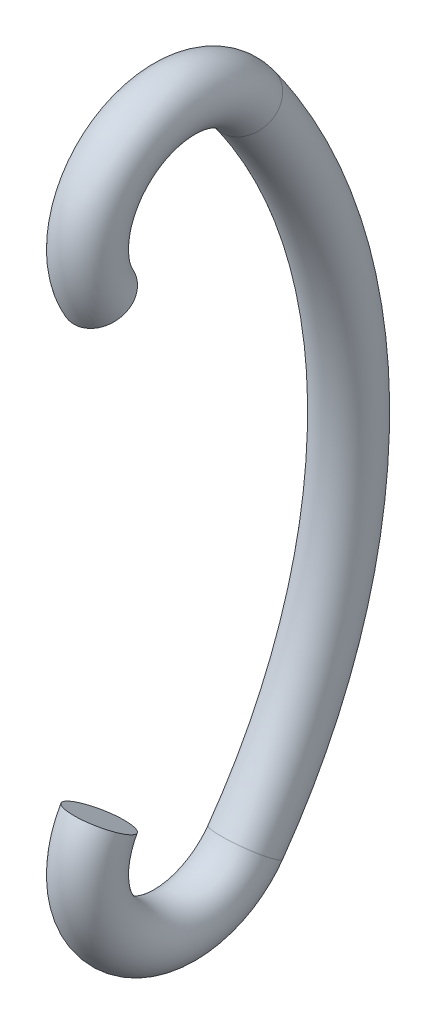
ISO-10303-21;
HEADER;
FILE_DESCRIPTION(('STEP AP214'),'2;1');
FILE_NAME('part.step','',(''),(''),'','','');
FILE_SCHEMA(('AUTOMOTIVE_DESIGN { 1 0 10303 214 1 1 1 1 }'));
ENDSEC;
DATA;
#1=APPLICATION_CONTEXT('core data for automotive mechanical design processes');
#2=APPLICATION_PROTOCOL_DEFINITION('international standard','automotive_design',2000,#1);
#3=PRODUCT_CONTEXT('',#1,'mechanical');
#4=PRODUCT('Part','Part','',(#3));
#5=PRODUCT_RELATED_PRODUCT_CATEGORY('part','',(#4));
#6=PRODUCT_DEFINITION_FORMATION('','',#4);
#7=PRODUCT_DEFINITION_CONTEXT('part definition',#1,'design');
#8=PRODUCT_DEFINITION('design','',#6,#7);
#9=PRODUCT_DEFINITION_SHAPE('','',#8);
#10=(LENGTH_UNIT() NAMED_UNIT(*) SI_UNIT(.MILLI.,.METRE.));
#11=(NAMED_UNIT(*) PLANE_ANGLE_UNIT() SI_UNIT($,.RADIAN.));
#12=(NAMED_UNIT(*) SI_UNIT($,.STERADIAN.) SOLID_ANGLE_UNIT());
#13=UNCERTAINTY_MEASURE_WITH_UNIT(LENGTH_MEASURE(1.E-05),#10,'distance_accuracy_value','');
#14=(GEOMETRIC_REPRESENTATION_CONTEXT(3) GLOBAL_UNCERTAINTY_ASSIGNED_CONTEXT((#13)) GLOBAL_UNIT_ASSIGNED_CONTEXT((#10,
#11,#12)) REPRESENTATION_CONTEXT('',''));
#15=CARTESIAN_POINT('',(0.,0.,0.));
#16=DIRECTION('',(0.,0.,1.));
#17=DIRECTION('',(1.,0.,0.));
#18=AXIS2_PLACEMENT_3D('',#15,#16,#17);
#19=CARTESIAN_POINT('',(0.,1.125,-0.649519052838));
#20=DIRECTION('',(0.,-0.866025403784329,0.50000000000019));
#21=DIRECTION('',(0.,-0.50000000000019,-0.866025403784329));
#22=AXIS2_PLACEMENT_3D('',#19,#20,#21);
#23=PLANE('',#22);
#24=CARTESIAN_POINT('',(0.,3.00000000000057,2.59807621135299));
#25=CARTESIAN_POINT('',(0.0842667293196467,3.00000289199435,2.59808122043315));
#26=CARTESIAN_POINT('',(0.168621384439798,3.00356719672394,2.60425477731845));
#27=CARTESIAN_POINT('',(0.293275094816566,3.01417075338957,2.62262067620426));
#28=CARTESIAN_POINT('',(0.334546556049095,3.01858727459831,2.63027031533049));
#29=CARTESIAN_POINT('',(0.416239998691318,3.02914557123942,2.64855782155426));
#30=CARTESIAN_POINT('',(0.456661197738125,3.03528886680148,2.65919832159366));
#31=CARTESIAN_POINT('',(0.576048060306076,3.05623034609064,2.69547002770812));
#32=CARTESIAN_POINT('',(0.653300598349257,3.07355412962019,2.72547570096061));
#33=CARTESIAN_POINT('',(0.80088418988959,3.11444867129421,2.79630712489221));
#34=CARTESIAN_POINT('',(0.871215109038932,3.13801955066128,2.83713308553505));
#35=CARTESIAN_POINT('',(0.969995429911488,3.17752846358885,2.90556453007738));
#36=CARTESIAN_POINT('',(1.001821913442,3.19140088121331,2.92959226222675));
#37=CARTESIAN_POINT('',(1.06299701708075,3.22042142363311,2.97985731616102));
#38=CARTESIAN_POINT('',(1.09234798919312,3.23556830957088,3.00609249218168));
#39=CARTESIAN_POINT('',(1.17642784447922,3.28279798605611,3.08789669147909));
#40=CARTESIAN_POINT('',(1.22720825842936,3.31667965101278,3.14658145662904));
#41=CARTESIAN_POINT('',(1.31664288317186,3.38820693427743,3.27047034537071));
#42=CARTESIAN_POINT('',(1.35529731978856,3.42585248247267,3.33567434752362));
#43=CARTESIAN_POINT('',(1.41942464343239,3.50385854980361,3.47078481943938));
#44=CARTESIAN_POINT('',(1.44489755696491,3.54421906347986,3.5406912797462));
#45=CARTESIAN_POINT('',(1.48192797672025,3.62650434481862,3.68321356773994));
#46=CARTESIAN_POINT('',(1.49348545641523,3.66842911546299,3.75582940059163));
#47=CARTESIAN_POINT('',(1.50235975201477,3.75265401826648,3.90171121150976));
#48=CARTESIAN_POINT('',(1.49967659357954,3.7949541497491,3.97497718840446));
#49=CARTESIAN_POINT('',(1.48014505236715,3.87872872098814,4.12007900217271));
#50=CARTESIAN_POINT('',(1.46329666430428,3.92020316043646,4.1919148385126));
#51=CARTESIAN_POINT('',(1.41591311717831,4.00114913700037,4.3321173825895));
#52=CARTESIAN_POINT('',(1.38537794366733,4.04062067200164,4.4004840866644));
#53=CARTESIAN_POINT('',(1.31148758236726,4.11644027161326,4.53180748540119));
#54=CARTESIAN_POINT('',(1.26813239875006,4.15278833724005,4.5947641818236));
#55=CARTESIAN_POINT('',(1.16983277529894,4.22132919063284,4.71348042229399));
#56=CARTESIAN_POINT('',(1.11488834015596,4.25352198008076,4.76923996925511));
#57=CARTESIAN_POINT('',(0.994969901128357,4.31283844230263,4.87197909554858));
#58=CARTESIAN_POINT('',(0.92999589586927,4.33996211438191,4.91895867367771));
#59=CARTESIAN_POINT('',(0.791862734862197,4.38837037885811,5.00280424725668));
#60=CARTESIAN_POINT('',(0.718703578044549,4.40965497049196,5.03967024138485));
#61=CARTESIAN_POINT('',(0.566276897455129,4.44578086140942,5.10224211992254));
#62=CARTESIAN_POINT('',(0.487009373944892,4.4606221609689,5.1279480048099));
#63=CARTESIAN_POINT('',(0.32461613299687,4.48344016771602,5.16746995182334));
#64=CARTESIAN_POINT('',(0.241490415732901,4.49141687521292,5.18128601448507));
#65=CARTESIAN_POINT('',(0.0737404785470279,4.50027926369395,5.19663612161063));
#66=CARTESIAN_POINT('',(-0.0108837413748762,4.50116494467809,5.19817016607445));
#67=CARTESIAN_POINT('',(-0.17922845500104,4.49582013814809,5.18891268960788));
#68=CARTESIAN_POINT('',(-0.262948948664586,4.48958965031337,5.17812116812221));
#69=CARTESIAN_POINT('',(-0.427109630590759,4.47018937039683,5.14451889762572));
#70=CARTESIAN_POINT('',(-0.507549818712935,4.4570195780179,5.12170814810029));
#71=CARTESIAN_POINT('',(-0.662866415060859,4.42411454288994,5.06471495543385));
#72=CARTESIAN_POINT('',(-0.737742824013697,4.4043793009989,5.03053251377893));
#73=CARTESIAN_POINT('',(-0.879806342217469,4.35890359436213,4.95176627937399));
#74=CARTESIAN_POINT('',(-0.946993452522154,4.33316313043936,4.90718248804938));
#75=CARTESIAN_POINT('',(-1.07177117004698,4.27640766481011,4.80887913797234));
#76=CARTESIAN_POINT('',(-1.12936177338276,4.24539266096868,4.75515957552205));
#77=CARTESIAN_POINT('',(-1.2333116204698,4.17896852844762,4.64010960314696));
#78=CARTESIAN_POINT('',(-1.27967086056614,4.14355939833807,4.57877919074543));
#79=CARTESIAN_POINT('',(-1.35984195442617,4.0693522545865,4.45024864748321));
#80=CARTESIAN_POINT('',(-1.39365382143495,4.03055424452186,4.38304852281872));
#81=CARTESIAN_POINT('',(-1.44777024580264,3.95067056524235,4.24468593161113));
#82=CARTESIAN_POINT('',(-1.46807480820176,3.90958489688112,4.17352346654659));
#83=CARTESIAN_POINT('',(-1.4946008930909,3.82629255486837,4.02925689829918));
#84=CARTESIAN_POINT('',(-1.50082239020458,3.78408587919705,3.9561527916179));
#85=CARTESIAN_POINT('',(-1.49900337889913,3.69974814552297,3.81007555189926));
#86=CARTESIAN_POINT('',(-1.49096289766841,3.65761708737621,3.73710241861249));
#87=CARTESIAN_POINT('',(-1.46085671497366,3.57463257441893,3.59336902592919));
#88=CARTESIAN_POINT('',(-1.43879098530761,3.5337791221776,3.52260877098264));
#89=CARTESIAN_POINT('',(-1.38122833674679,3.45448583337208,3.38526876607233));
#90=CARTESIAN_POINT('',(-1.34573116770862,3.4160460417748,3.31868909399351));
#91=CARTESIAN_POINT('',(-1.28324910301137,3.36107335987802,3.22347361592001));
#92=CARTESIAN_POINT('',(-1.26087738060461,3.34319391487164,3.19250550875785));
#93=CARTESIAN_POINT('',(-1.2131832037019,3.30842170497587,3.13227827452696));
#94=CARTESIAN_POINT('',(-1.18785793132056,3.29152990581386,3.10302082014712));
#95=CARTESIAN_POINT('',(-1.10777288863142,3.24257136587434,3.01822214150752));
#96=CARTESIAN_POINT('',(-1.04884722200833,3.21217173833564,2.96556844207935));
#97=CARTESIAN_POINT('',(-0.921615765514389,3.15675845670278,2.86958982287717));
#98=CARTESIAN_POINT('',(-0.853310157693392,3.13174469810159,2.82626472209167));
#99=CARTESIAN_POINT('',(-0.745312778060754,3.09879029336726,2.76918601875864));
#100=CARTESIAN_POINT('',(-0.708351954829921,3.08855883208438,2.75146460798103));
#101=CARTESIAN_POINT('',(-0.632875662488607,3.06969710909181,2.71879514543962));
#102=CARTESIAN_POINT('',(-0.59436159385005,3.06106544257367,2.70384466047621));
#103=CARTESIAN_POINT('',(-0.476892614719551,3.03767031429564,2.66332310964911));
#104=CARTESIAN_POINT('',(-0.395890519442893,3.02537005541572,2.64201843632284));
#105=CARTESIAN_POINT('',(-0.261991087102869,3.01105744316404,2.61722826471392));
#106=CARTESIAN_POINT('',(-0.209948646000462,3.00691674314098,2.61005636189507));
#107=CARTESIAN_POINT('',(-0.105282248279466,3.00138711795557,2.60047877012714));
#108=CARTESIAN_POINT('',(-0.0526582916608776,2.99999819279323,2.59807308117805));
#109=CARTESIAN_POINT('',(0.,3.00000000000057,2.59807621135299));
#110=B_SPLINE_CURVE_WITH_KNOTS('',3,(#24,#25,#26,#27,#28,#29,#30,#31,#32,#33,#34,#35,#36,#37,
#38,#39,#40,#41,#42,#43,#44,#45,#46,#47,#48,#49,#50,#51,#52,#53,#54,#55,#56,#57,#58,#59,#60,#61,
#62,#63,#64,#65,#66,#67,#68,#69,#70,#71,#72,#73,#74,#75,#76,#77,#78,#79,#80,#81,#82,#83,#84,#85,
#86,#87,#88,#89,#90,#91,#92,#93,#94,#95,#96,#97,#98,#99,#100,#101,#102,#103,#104,#105,#106,#107,
#108,#109),.UNSPECIFIED.,.T.,.F.,(4,2,2,2,2,2,2,2,2,2,2,2,2,2,2,2,2,2,2,2,2,2,2,2,2,2,2,2,2,2,2,
2,2,2,2,2,2,2,2,2,2,2,4),(0.,0.252574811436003,0.379071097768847,0.505679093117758,
0.758403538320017,1.01113288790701,1.13766709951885,1.26407970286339,1.51681156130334,
1.7695387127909,2.02226535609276,2.27499248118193,2.52771915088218,2.78044591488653,
3.03317294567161,3.28589989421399,3.53862674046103,3.79135362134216,4.04408053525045,
4.29680743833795,4.54953433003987,4.80226122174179,5.05498812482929,5.30771503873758,
5.56044191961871,5.81316876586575,6.06589571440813,6.3186227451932,6.57134950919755,
6.8240761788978,7.07680330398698,7.32952994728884,7.58225709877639,7.83498895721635,
7.96140156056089,8.08793577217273,8.34066512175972,8.59338956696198,8.71999756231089,
8.84649384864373,9.09906866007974,9.25690269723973,9.41473673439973),.UNSPECIFIED.);
#111=CARTESIAN_POINT('',(0.,3.00000000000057,2.59807621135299));
#112=VERTEX_POINT('',#111);
#113=EDGE_CURVE('E19',#112,#112,#110,.T.);
#114=ORIENTED_EDGE('',*,*,#113,.F.);
#115=EDGE_LOOP('',(#114));
#116=FACE_BOUND('',#115,.T.);
#117=ADVANCED_FACE('F15',(#116),#23,.F.);
#118=CARTESIAN_POINT('',(0.,29.875,-0.649519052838));
#119=DIRECTION('',(0.,-0.866025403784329,-0.50000000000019));
#120=DIRECTION('',(0.,0.50000000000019,-0.866025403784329));
#121=AXIS2_PLACEMENT_3D('',#118,#119,#120);
#122=PLANE('',#121);
#123=CARTESIAN_POINT('',(0.,27.9999999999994,2.59807621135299));
#124=CARTESIAN_POINT('',(-0.0842667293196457,27.9999971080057,2.59808122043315));
#125=CARTESIAN_POINT('',(-0.168621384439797,27.9964328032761,2.60425477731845));
#126=CARTESIAN_POINT('',(-0.293275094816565,27.9858292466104,2.62262067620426));
#127=CARTESIAN_POINT('',(-0.334546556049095,27.9814127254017,2.63027031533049));
#128=CARTESIAN_POINT('',(-0.416239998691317,27.9708544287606,2.64855782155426));
#129=CARTESIAN_POINT('',(-0.456661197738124,27.9647111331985,2.65919832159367));
#130=CARTESIAN_POINT('',(-0.576048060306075,27.9437696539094,2.69547002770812));
#131=CARTESIAN_POINT('',(-0.653300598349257,27.9264458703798,2.72547570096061));
#132=CARTESIAN_POINT('',(-0.800884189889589,27.8855513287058,2.79630712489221));
#133=CARTESIAN_POINT('',(-0.871215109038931,27.8619804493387,2.83713308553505));
#134=CARTESIAN_POINT('',(-0.969995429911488,27.8224715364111,2.90556453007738));
#135=CARTESIAN_POINT('',(-1.001821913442,27.8085991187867,2.92959226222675));
#136=CARTESIAN_POINT('',(-1.06299701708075,27.7795785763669,2.97985731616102));
#137=CARTESIAN_POINT('',(-1.09234798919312,27.7644316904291,3.00609249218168));
#138=CARTESIAN_POINT('',(-1.17642784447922,27.7172020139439,3.08789669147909));
#139=CARTESIAN_POINT('',(-1.22720825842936,27.6833203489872,3.14658145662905));
#140=CARTESIAN_POINT('',(-1.31664288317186,27.6117930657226,3.27047034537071));
#141=CARTESIAN_POINT('',(-1.35529731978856,27.5741475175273,3.33567434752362));
#142=CARTESIAN_POINT('',(-1.41942464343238,27.4961414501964,3.47078481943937));
#143=CARTESIAN_POINT('',(-1.44489755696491,27.4557809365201,3.5406912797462));
#144=CARTESIAN_POINT('',(-1.48192797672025,27.3734956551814,3.68321356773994));
#145=CARTESIAN_POINT('',(-1.49348545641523,27.331570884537,3.75582940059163));
#146=CARTESIAN_POINT('',(-1.50235975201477,27.2473459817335,3.90171121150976));
#147=CARTESIAN_POINT('',(-1.49967659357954,27.2050458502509,3.97497718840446));
#148=CARTESIAN_POINT('',(-1.48014505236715,27.1212712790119,4.12007900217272));
#149=CARTESIAN_POINT('',(-1.46329666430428,27.0797968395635,4.1919148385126));
#150=CARTESIAN_POINT('',(-1.41591311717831,26.9988508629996,4.3321173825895));
#151=CARTESIAN_POINT('',(-1.38537794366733,26.9593793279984,4.4004840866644));
#152=CARTESIAN_POINT('',(-1.31148758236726,26.8835597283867,4.53180748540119));
#153=CARTESIAN_POINT('',(-1.26813239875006,26.8472116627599,4.5947641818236));
#154=CARTESIAN_POINT('',(-1.16983277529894,26.7786708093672,4.71348042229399));
#155=CARTESIAN_POINT('',(-1.11488834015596,26.7464780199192,4.76923996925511));
#156=CARTESIAN_POINT('',(-0.994969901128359,26.6871615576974,4.87197909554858));
#157=CARTESIAN_POINT('',(-0.929995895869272,26.6600378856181,4.91895867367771));
#158=CARTESIAN_POINT('',(-0.791862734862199,26.6116296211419,5.00280424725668));
#159=CARTESIAN_POINT('',(-0.718703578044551,26.590345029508,5.03967024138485));
#160=CARTESIAN_POINT('',(-0.56627689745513,26.5542191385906,5.10224211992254));
#161=CARTESIAN_POINT('',(-0.487009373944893,26.5393778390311,5.1279480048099));
#162=CARTESIAN_POINT('',(-0.324616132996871,26.516559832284,5.16746995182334));
#163=CARTESIAN_POINT('',(-0.241490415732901,26.5085831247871,5.18128601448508));
#164=CARTESIAN_POINT('',(-0.0737404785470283,26.4997207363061,5.19663612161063));
#165=CARTESIAN_POINT('',(0.0108837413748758,26.4988350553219,5.19817016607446));
#166=CARTESIAN_POINT('',(0.179228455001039,26.5041798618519,5.18891268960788));
#167=CARTESIAN_POINT('',(0.262948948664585,26.5104103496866,5.17812116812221));
#168=CARTESIAN_POINT('',(0.427109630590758,26.5298106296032,5.14451889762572));
#169=CARTESIAN_POINT('',(0.507549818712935,26.5429804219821,5.12170814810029));
#170=CARTESIAN_POINT('',(0.662866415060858,26.5758854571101,5.06471495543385));
#171=CARTESIAN_POINT('',(0.737742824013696,26.5956206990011,5.03053251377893));
#172=CARTESIAN_POINT('',(0.879806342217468,26.6410964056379,4.95176627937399));
#173=CARTESIAN_POINT('',(0.946993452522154,26.6668368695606,4.90718248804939));
#174=CARTESIAN_POINT('',(1.07177117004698,26.7235923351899,4.80887913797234));
#175=CARTESIAN_POINT('',(1.12936177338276,26.7546073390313,4.75515957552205));
#176=CARTESIAN_POINT('',(1.2333116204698,26.8210314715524,4.64010960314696));
#177=CARTESIAN_POINT('',(1.27967086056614,26.8564406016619,4.57877919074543));
#178=CARTESIAN_POINT('',(1.35984195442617,26.9306477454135,4.45024864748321));
#179=CARTESIAN_POINT('',(1.39365382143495,26.9694457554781,4.38304852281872));
#180=CARTESIAN_POINT('',(1.44777024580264,27.0493294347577,4.24468593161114));
#181=CARTESIAN_POINT('',(1.46807480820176,27.0904151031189,4.17352346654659));
#182=CARTESIAN_POINT('',(1.4946008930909,27.1737074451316,4.02925689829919));
#183=CARTESIAN_POINT('',(1.50082239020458,27.215914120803,3.95615279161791));
#184=CARTESIAN_POINT('',(1.49900337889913,27.300251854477,3.81007555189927));
#185=CARTESIAN_POINT('',(1.49096289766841,27.3423829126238,3.73710241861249));
#186=CARTESIAN_POINT('',(1.46085671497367,27.4253674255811,3.5933690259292));
#187=CARTESIAN_POINT('',(1.43879098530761,27.4662208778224,3.52260877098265));
#188=CARTESIAN_POINT('',(1.38122833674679,27.5455141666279,3.38526876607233));
#189=CARTESIAN_POINT('',(1.34573116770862,27.5839539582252,3.31868909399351));
#190=CARTESIAN_POINT('',(1.28324910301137,27.638926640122,3.22347361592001));
#191=CARTESIAN_POINT('',(1.26087738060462,27.6568060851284,3.19250550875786));
#192=CARTESIAN_POINT('',(1.2131832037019,27.6915782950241,3.13227827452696));
#193=CARTESIAN_POINT('',(1.18785793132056,27.7084700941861,3.10302082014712));
#194=CARTESIAN_POINT('',(1.10777288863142,27.7574286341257,3.01822214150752));
#195=CARTESIAN_POINT('',(1.04884722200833,27.7878282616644,2.96556844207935));
#196=CARTESIAN_POINT('',(0.92161576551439,27.8432415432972,2.86958982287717));
#197=CARTESIAN_POINT('',(0.853310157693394,27.8682553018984,2.82626472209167));
#198=CARTESIAN_POINT('',(0.745312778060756,27.9012097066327,2.76918601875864));
#199=CARTESIAN_POINT('',(0.708351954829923,27.9114411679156,2.75146460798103));
#200=CARTESIAN_POINT('',(0.632875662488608,27.9303028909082,2.71879514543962));
#201=CARTESIAN_POINT('',(0.594361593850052,27.9389345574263,2.70384466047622));
#202=CARTESIAN_POINT('',(0.476892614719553,27.9623296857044,2.66332310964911));
#203=CARTESIAN_POINT('',(0.395890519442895,27.9746299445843,2.64201843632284));
#204=CARTESIAN_POINT('',(0.26199108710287,27.988942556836,2.61722826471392));
#205=CARTESIAN_POINT('',(0.209948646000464,27.993083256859,2.61005636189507));
#206=CARTESIAN_POINT('',(0.105282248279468,27.9986128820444,2.60047877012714));
#207=CARTESIAN_POINT('',(0.0526582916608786,28.0000018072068,2.59807308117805));
#208=CARTESIAN_POINT('',(0.,27.9999999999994,2.59807621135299));
#209=B_SPLINE_CURVE_WITH_KNOTS('',3,(#123,#124,#125,#126,#127,#128,#129,#130,#131,#132,#133,
#134,#135,#136,#137,#138,#139,#140,#141,#142,#143,#144,#145,#146,#147,#148,#149,#150,#151,#152,
#153,#154,#155,#156,#157,#158,#159,#160,#161,#162,#163,#164,#165,#166,#167,#168,#169,#170,#171,
#172,#173,#174,#175,#176,#177,#178,#179,#180,#181,#182,#183,#184,#185,#186,#187,#188,#189,#190,
#191,#192,#193,#194,#195,#196,#197,#198,#199,#200,#201,#202,#203,#204,#205,#206,#207,#208),
.UNSPECIFIED.,.T.,.F.,(4,2,2,2,2,2,2,2,2,2,2,2,2,2,2,2,2,2,2,2,2,2,2,2,2,2,2,2,2,2,2,2,2,2,2,2,
2,2,2,2,2,2,4),(0.,0.252574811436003,0.379071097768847,0.505679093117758,0.758403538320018,
1.01113288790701,1.13766709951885,1.26407970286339,1.51681156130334,1.76953871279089,
2.02226535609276,2.27499248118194,2.52771915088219,2.78044591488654,3.03317294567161,
3.28589989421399,3.53862674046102,3.79135362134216,4.04408053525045,4.29680743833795,
4.54953433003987,4.80226122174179,5.05498812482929,5.30771503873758,5.56044191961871,
5.81316876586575,6.06589571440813,6.3186227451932,6.57134950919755,6.8240761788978,
7.07680330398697,7.32952994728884,7.58225709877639,7.83498895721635,7.96140156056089,
8.08793577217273,8.34066512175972,8.59338956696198,8.71999756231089,8.84649384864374,
9.09906866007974,9.25690269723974,9.41473673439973),.UNSPECIFIED.);
#210=CARTESIAN_POINT('',(0.,27.9999999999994,2.59807621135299));
#211=VERTEX_POINT('',#210);
#212=EDGE_CURVE('E31',#211,#211,#209,.T.);
#213=ORIENTED_EDGE('',*,*,#212,.F.);
#214=EDGE_LOOP('',(#213));
#215=FACE_BOUND('',#214,.T.);
#216=ADVANCED_FACE('F55',(#215),#122,.T.);
#217=CARTESIAN_POINT('',(0.,1.5,0.));
#218=DIRECTION('',(1.,0.,0.));
#219=DIRECTION('',(0.,0.,-1.));
#220=AXIS2_PLACEMENT_3D('',#217,#218,#219);
#221=TOROIDAL_SURFACE('',#220,4.5,1.5);
#222=CARTESIAN_POINT('',(0.,-1.12196531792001,-3.65722543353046));
#223=DIRECTION('',(0.,0.812716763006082,-0.582658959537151));
#224=DIRECTION('',(0.,-0.582658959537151,-0.812716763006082));
#225=AXIS2_PLACEMENT_3D('',#222,#223,#224);
#226=CIRCLE('',#225,1.5);
#227=CARTESIAN_POINT('',(0.,-1.99595375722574,-4.87630057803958));
#228=VERTEX_POINT('',#227);
#229=EDGE_CURVE('E26',#228,#228,#226,.T.);
#230=ORIENTED_EDGE('',*,*,#229,.F.);
#231=EDGE_LOOP('',(#230));
#232=FACE_BOUND('',#231,.T.);
#233=ORIENTED_EDGE('',*,*,#113,.T.);
#234=EDGE_LOOP('',(#233));
#235=FACE_BOUND('',#234,.T.);
#236=ADVANCED_FACE('F49',(#232,#235),#221,.T.);
#237=CARTESIAN_POINT('',(0.,29.5,0.));
#238=DIRECTION('',(1.,0.,0.));
#239=DIRECTION('',(0.,0.,-1.));
#240=AXIS2_PLACEMENT_3D('',#237,#238,#239);
#241=TOROIDAL_SURFACE('',#240,4.5,1.5);
#242=ORIENTED_EDGE('',*,*,#212,.T.);
#243=EDGE_LOOP('',(#242));
#244=FACE_BOUND('',#243,.T.);
#245=CARTESIAN_POINT('',(0.,32.121965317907,-3.65722543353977));
#246=DIRECTION('',(0.,0.812716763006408,0.582658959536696));
#247=DIRECTION('',(0.,0.582658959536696,-0.812716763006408));
#248=AXIS2_PLACEMENT_3D('',#245,#246,#247);
#249=CIRCLE('',#248,1.5);
#250=CARTESIAN_POINT('',(0.,32.9959537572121,-4.87630057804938));
#251=VERTEX_POINT('',#250);
#252=EDGE_CURVE('E10',#251,#251,#249,.F.);
#253=ORIENTED_EDGE('',*,*,#252,.F.);
#254=EDGE_LOOP('',(#253));
#255=FACE_BOUND('',#254,.T.);
#256=ADVANCED_FACE('F44',(#244,#255),#241,.T.);
#257=CARTESIAN_POINT('',(0.,15.5,19.5277777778));
#258=DIRECTION('',(1.,0.,0.));
#259=DIRECTION('',(0.,0.,-1.));
#260=AXIS2_PLACEMENT_3D('',#257,#258,#259);
#261=TOROIDAL_SURFACE('',#260,28.5277777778,1.5);
#262=ORIENTED_EDGE('',*,*,#252,.T.);
#263=EDGE_LOOP('',(#262));
#264=FACE_BOUND('',#263,.T.);
#265=ORIENTED_EDGE('',*,*,#229,.T.);
#266=EDGE_LOOP('',(#265));
#267=FACE_BOUND('',#266,.T.);
#268=ADVANCED_FACE('F48',(#264,#267),#261,.T.);
#269=CLOSED_SHELL('',(#117,#216,#236,#256,#268));
#270=MANIFOLD_SOLID_BREP('B1',#269);
#271=ADVANCED_BREP_SHAPE_REPRESENTATION('',(#18,#270),#14);
#272=SHAPE_DEFINITION_REPRESENTATION(#9,#271);
ENDSEC;
END-ISO-10303-21;
